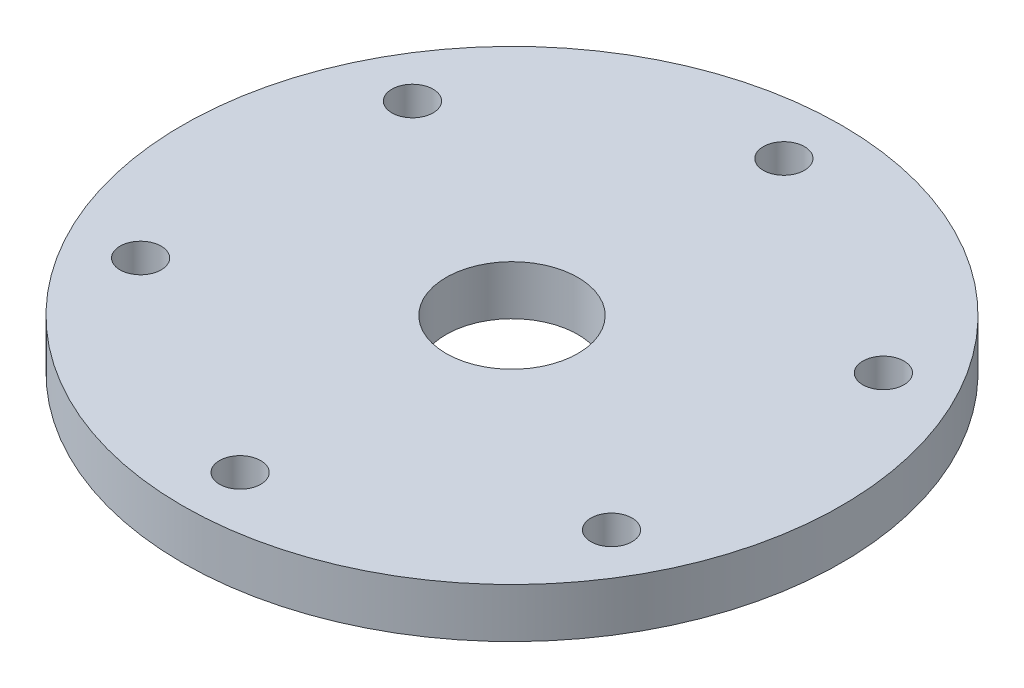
from build123d import *

# Parameters (mm, degrees)
SKETCH1_R          = 63.5
BASE_EXTRUDE_DEPTH = 9.525
SKETCH2_R          = 3.96875
CUT_EXTRUDE1_DEPTH = 94.146828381
CIRPATTERN1_COUNT  = 6
HOLE1_D            = 25.399978
HOLE1_DEPTH        = 25.4000034
HOLE1_TIP          = 7.630923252


with BuildPart() as part:
    # Sketch1 → Base-Extrude (new body)
    with BuildSketch(Plane(origin=(0, 0, 0), x_dir=(1, 0, 0), z_dir=(0, 1, 0))):
        with Locations(Location((0, 0, 0), (0, 0, 270))):
            Circle(SKETCH1_R)
    extrude(amount=-BASE_EXTRUDE_DEPTH)

    # Sketch2 → Cut-Extrude1 (cut, through all)
    with BuildSketch(Plane(origin=(-1.994725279, 0, -2.044236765), x_dir=(-1, 0, 0), z_dir=(0, 1, 0))):
        with Locations(Location((-1.994725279, 54.431736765, 0), (0, 0, 90))):
            Circle(SKETCH2_R)
    cut_extrude1 = extrude(amount=-CUT_EXTRUDE1_DEPTH, mode=Mode.SUBTRACT)

    # CirPattern1: Cut-Extrude1 ×6 about axis
    cirpattern1_axis = Axis((0, 0, 0), (0, 1, 0))
    for i in range(1, CIRPATTERN1_COUNT):
        add(cut_extrude1.rotate(cirpattern1_axis, i * 360 / CIRPATTERN1_COUNT), mode=Mode.SUBTRACT)

    # Hole1
    with Locations(Plane(origin=(5.260573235, 0, -0.857997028), x_dir=(-1, 0, 0), z_dir=(0, 1, 0))):
        with Locations((5.260573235, 0.857997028)):
            Hole(HOLE1_D / 2, depth=HOLE1_DEPTH)
            with Locations((0, 0, -(HOLE1_DEPTH + HOLE1_TIP / 2))):  # 118° drill point
                Cone(0, HOLE1_D / 2, HOLE1_TIP, mode=Mode.SUBTRACT)


solid = part.part
